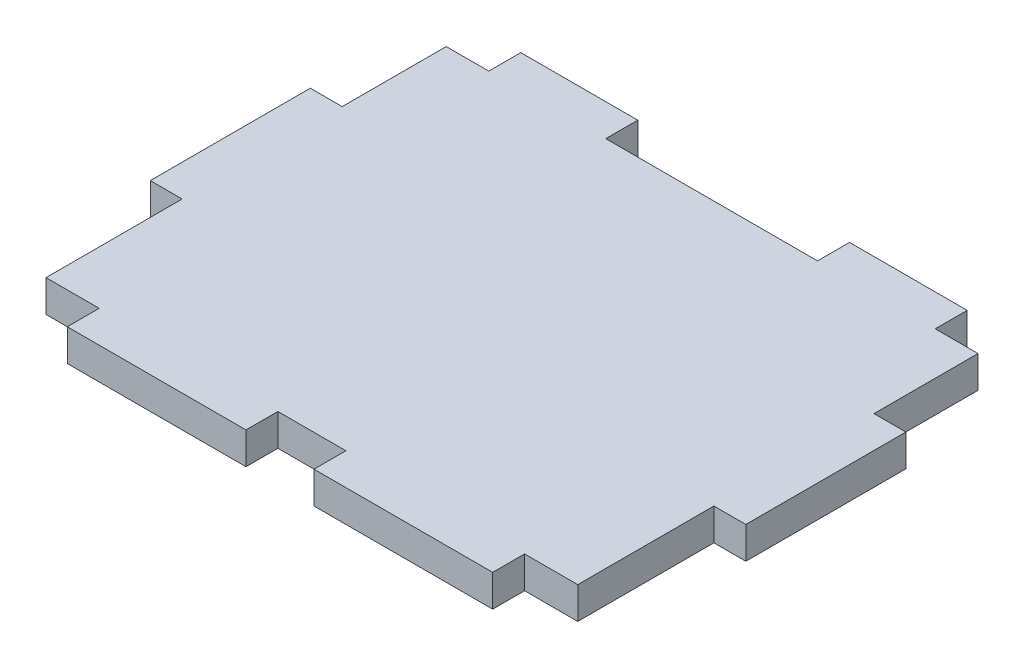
ISO-10303-21;
HEADER;
FILE_DESCRIPTION(('STEP AP214'),'2;1');
FILE_NAME('part.step','',(''),(''),'','','');
FILE_SCHEMA(('AUTOMOTIVE_DESIGN { 1 0 10303 214 1 1 1 1 }'));
ENDSEC;
DATA;
#1=APPLICATION_CONTEXT('core data for automotive mechanical design processes');
#2=APPLICATION_PROTOCOL_DEFINITION('international standard','automotive_design',2000,#1);
#3=PRODUCT_CONTEXT('',#1,'mechanical');
#4=PRODUCT('Part','Part','',(#3));
#5=PRODUCT_RELATED_PRODUCT_CATEGORY('part','',(#4));
#6=PRODUCT_DEFINITION_FORMATION('','',#4);
#7=PRODUCT_DEFINITION_CONTEXT('part definition',#1,'design');
#8=PRODUCT_DEFINITION('design','',#6,#7);
#9=PRODUCT_DEFINITION_SHAPE('','',#8);
#10=(LENGTH_UNIT() NAMED_UNIT(*) SI_UNIT(.MILLI.,.METRE.));
#11=(NAMED_UNIT(*) PLANE_ANGLE_UNIT() SI_UNIT($,.RADIAN.));
#12=(NAMED_UNIT(*) SI_UNIT($,.STERADIAN.) SOLID_ANGLE_UNIT());
#13=UNCERTAINTY_MEASURE_WITH_UNIT(LENGTH_MEASURE(1.E-05),#10,'distance_accuracy_value','');
#14=(GEOMETRIC_REPRESENTATION_CONTEXT(3) GLOBAL_UNCERTAINTY_ASSIGNED_CONTEXT((#13)) GLOBAL_UNIT_ASSIGNED_CONTEXT((#10,
#11,#12)) REPRESENTATION_CONTEXT('',''));
#15=CARTESIAN_POINT('',(0.,0.,0.));
#16=DIRECTION('',(0.,0.,1.));
#17=DIRECTION('',(1.,0.,0.));
#18=AXIS2_PLACEMENT_3D('',#15,#16,#17);
#19=CARTESIAN_POINT('',(-871.437806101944,3.,-447.227487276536));
#20=DIRECTION('',(0.,0.,-1.));
#21=DIRECTION('',(-1.,0.,0.));
#22=AXIS2_PLACEMENT_3D('',#19,#20,#21);
#23=PLANE('',#22);
#24=DIRECTION('',(1.,0.,0.));
#25=VECTOR('',#24,1.);
#26=CARTESIAN_POINT('',(-871.437806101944,0.,-447.227487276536));
#27=LINE('',#26,#25);
#28=CARTESIAN_POINT('',(-874.437806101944,0.,-447.227487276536));
#29=VERTEX_POINT('',#28);
#30=CARTESIAN_POINT('',(-871.437806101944,0.,-447.227487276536));
#31=VERTEX_POINT('',#30);
#32=EDGE_CURVE('E250',#29,#31,#27,.T.);
#33=ORIENTED_EDGE('',*,*,#32,.T.);
#34=DIRECTION('',(0.,-1.,0.));
#35=VECTOR('',#34,1.);
#36=CARTESIAN_POINT('',(-871.437806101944,3.,-447.227487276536));
#37=LINE('',#36,#35);
#38=CARTESIAN_POINT('',(-871.437806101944,3.,-447.227487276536));
#39=VERTEX_POINT('',#38);
#40=EDGE_CURVE('E11',#39,#31,#37,.T.);
#41=ORIENTED_EDGE('',*,*,#40,.F.);
#42=DIRECTION('',(1.,0.,0.));
#43=VECTOR('',#42,1.);
#44=CARTESIAN_POINT('',(-871.437806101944,3.,-447.227487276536));
#45=LINE('',#44,#43);
#46=CARTESIAN_POINT('',(-874.437806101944,3.,-447.227487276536));
#47=VERTEX_POINT('',#46);
#48=EDGE_CURVE('E304',#47,#39,#45,.T.);
#49=ORIENTED_EDGE('',*,*,#48,.F.);
#50=DIRECTION('',(0.,-1.,0.));
#51=VECTOR('',#50,1.);
#52=CARTESIAN_POINT('',(-874.437806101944,3.,-447.227487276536));
#53=LINE('',#52,#51);
#54=EDGE_CURVE('E246',#47,#29,#53,.T.);
#55=ORIENTED_EDGE('',*,*,#54,.T.);
#56=EDGE_LOOP('',(#33,#41,#49,#55));
#57=FACE_BOUND('',#56,.T.);
#58=ADVANCED_FACE('F34',(#57),#23,.F.);
#59=CARTESIAN_POINT('',(-871.437806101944,3.,-447.227487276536));
#60=DIRECTION('',(-1.,0.,0.));
#61=DIRECTION('',(0.,0.,1.));
#62=AXIS2_PLACEMENT_3D('',#59,#60,#61);
#63=PLANE('',#62);
#64=DIRECTION('',(0.,0.,-1.));
#65=VECTOR('',#64,1.);
#66=CARTESIAN_POINT('',(-871.437806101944,0.,-447.227487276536));
#67=LINE('',#66,#65);
#68=CARTESIAN_POINT('',(-871.437806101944,0.,-462.277187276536));
#69=VERTEX_POINT('',#68);
#70=EDGE_CURVE('E253',#31,#69,#67,.T.);
#71=ORIENTED_EDGE('',*,*,#70,.T.);
#72=DIRECTION('',(0.,-1.,0.));
#73=VECTOR('',#72,1.);
#74=CARTESIAN_POINT('',(-871.437806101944,3.,-462.277187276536));
#75=LINE('',#74,#73);
#76=CARTESIAN_POINT('',(-871.437806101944,3.,-462.277187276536));
#77=VERTEX_POINT('',#76);
#78=EDGE_CURVE('E42',#77,#69,#75,.T.);
#79=ORIENTED_EDGE('',*,*,#78,.F.);
#80=DIRECTION('',(0.,0.,-1.));
#81=VECTOR('',#80,1.);
#82=CARTESIAN_POINT('',(-871.437806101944,3.,-447.227487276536));
#83=LINE('',#82,#81);
#84=EDGE_CURVE('E153',#39,#77,#83,.T.);
#85=ORIENTED_EDGE('',*,*,#84,.F.);
#86=ORIENTED_EDGE('',*,*,#40,.T.);
#87=EDGE_LOOP('',(#71,#79,#85,#86));
#88=FACE_BOUND('',#87,.T.);
#89=ADVANCED_FACE('F462',(#88),#63,.F.);
#90=CARTESIAN_POINT('',(-874.437806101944,3.,-462.277187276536));
#91=DIRECTION('',(0.,0.,1.));
#92=DIRECTION('',(1.,0.,0.));
#93=AXIS2_PLACEMENT_3D('',#90,#91,#92);
#94=PLANE('',#93);
#95=DIRECTION('',(-1.,0.,0.));
#96=VECTOR('',#95,1.);
#97=CARTESIAN_POINT('',(-874.437806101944,0.,-462.277187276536));
#98=LINE('',#97,#96);
#99=CARTESIAN_POINT('',(-874.437806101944,0.,-462.277187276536));
#100=VERTEX_POINT('',#99);
#101=EDGE_CURVE('E255',#69,#100,#98,.T.);
#102=ORIENTED_EDGE('',*,*,#101,.T.);
#103=DIRECTION('',(0.,-1.,0.));
#104=VECTOR('',#103,1.);
#105=CARTESIAN_POINT('',(-874.437806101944,3.,-462.277187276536));
#106=LINE('',#105,#104);
#107=CARTESIAN_POINT('',(-874.437806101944,3.,-462.277187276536));
#108=VERTEX_POINT('',#107);
#109=EDGE_CURVE('E371',#108,#100,#106,.T.);
#110=ORIENTED_EDGE('',*,*,#109,.F.);
#111=DIRECTION('',(-1.,0.,0.));
#112=VECTOR('',#111,1.);
#113=CARTESIAN_POINT('',(-874.437806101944,3.,-462.277187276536));
#114=LINE('',#113,#112);
#115=EDGE_CURVE('E379',#77,#108,#114,.T.);
#116=ORIENTED_EDGE('',*,*,#115,.F.);
#117=ORIENTED_EDGE('',*,*,#78,.T.);
#118=EDGE_LOOP('',(#102,#110,#116,#117));
#119=FACE_BOUND('',#118,.T.);
#120=ADVANCED_FACE('F377',(#119),#94,.F.);
#121=CARTESIAN_POINT('',(-874.437806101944,3.,-462.277187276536));
#122=DIRECTION('',(-1.,0.,-1.47539451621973E-13));
#123=DIRECTION('',(-1.47539451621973E-13,0.,1.));
#124=AXIS2_PLACEMENT_3D('',#121,#122,#123);
#125=PLANE('',#124);
#126=DIRECTION('',(1.47539451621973E-13,0.,-1.));
#127=VECTOR('',#126,1.);
#128=CARTESIAN_POINT('',(-874.437806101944,0.,-462.277187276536));
#129=LINE('',#128,#127);
#130=CARTESIAN_POINT('',(-874.437806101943,0.,-472.059587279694));
#131=VERTEX_POINT('',#130);
#132=EDGE_CURVE('E257',#100,#131,#129,.T.);
#133=ORIENTED_EDGE('',*,*,#132,.T.);
#134=DIRECTION('',(0.,-1.,0.));
#135=VECTOR('',#134,1.);
#136=CARTESIAN_POINT('',(-874.437806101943,3.,-472.059587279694));
#137=LINE('',#136,#135);
#138=CARTESIAN_POINT('',(-874.437806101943,3.,-472.059587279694));
#139=VERTEX_POINT('',#138);
#140=EDGE_CURVE('E368',#139,#131,#137,.T.);
#141=ORIENTED_EDGE('',*,*,#140,.F.);
#142=DIRECTION('',(1.47539451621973E-13,0.,-1.));
#143=VECTOR('',#142,1.);
#144=CARTESIAN_POINT('',(-874.437806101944,3.,-462.277187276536));
#145=LINE('',#144,#143);
#146=EDGE_CURVE('E397',#108,#139,#145,.T.);
#147=ORIENTED_EDGE('',*,*,#146,.F.);
#148=ORIENTED_EDGE('',*,*,#109,.T.);
#149=EDGE_LOOP('',(#133,#141,#147,#148));
#150=FACE_BOUND('',#149,.T.);
#151=ADVANCED_FACE('F388',(#150),#125,.F.);
#152=CARTESIAN_POINT('',(-874.437806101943,3.,-472.059587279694));
#153=DIRECTION('',(0.,0.,1.));
#154=DIRECTION('',(1.,0.,0.));
#155=AXIS2_PLACEMENT_3D('',#152,#153,#154);
#156=PLANE('',#155);
#157=DIRECTION('',(-1.,0.,0.));
#158=VECTOR('',#157,1.);
#159=CARTESIAN_POINT('',(-874.437806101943,0.,-472.059587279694));
#160=LINE('',#159,#158);
#161=CARTESIAN_POINT('',(-878.462774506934,0.,-472.059587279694));
#162=VERTEX_POINT('',#161);
#163=EDGE_CURVE('E259',#131,#162,#160,.T.);
#164=ORIENTED_EDGE('',*,*,#163,.T.);
#165=DIRECTION('',(0.,-1.,0.));
#166=VECTOR('',#165,1.);
#167=CARTESIAN_POINT('',(-878.462774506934,3.,-472.059587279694));
#168=LINE('',#167,#166);
#169=CARTESIAN_POINT('',(-878.462774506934,3.,-472.059587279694));
#170=VERTEX_POINT('',#169);
#171=EDGE_CURVE('E365',#170,#162,#168,.T.);
#172=ORIENTED_EDGE('',*,*,#171,.F.);
#173=DIRECTION('',(-1.,0.,0.));
#174=VECTOR('',#173,1.);
#175=CARTESIAN_POINT('',(-874.437806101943,3.,-472.059587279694));
#176=LINE('',#175,#174);
#177=EDGE_CURVE('E394',#139,#170,#176,.T.);
#178=ORIENTED_EDGE('',*,*,#177,.F.);
#179=ORIENTED_EDGE('',*,*,#140,.T.);
#180=EDGE_LOOP('',(#164,#172,#178,#179));
#181=FACE_BOUND('',#180,.T.);
#182=ADVANCED_FACE('F392',(#181),#156,.F.);
#183=CARTESIAN_POINT('',(-878.462774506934,3.,-472.059587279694));
#184=DIRECTION('',(-1.,0.,0.));
#185=DIRECTION('',(0.,0.,1.));
#186=AXIS2_PLACEMENT_3D('',#183,#184,#185);
#187=PLANE('',#186);
#188=DIRECTION('',(0.,0.,-1.));
#189=VECTOR('',#188,1.);
#190=CARTESIAN_POINT('',(-878.462774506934,0.,-472.059587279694));
#191=LINE('',#190,#189);
#192=CARTESIAN_POINT('',(-878.462774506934,0.,-475.069487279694));
#193=VERTEX_POINT('',#192);
#194=EDGE_CURVE('E261',#162,#193,#191,.T.);
#195=ORIENTED_EDGE('',*,*,#194,.T.);
#196=DIRECTION('',(0.,-1.,0.));
#197=VECTOR('',#196,1.);
#198=CARTESIAN_POINT('',(-878.462774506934,3.,-475.069487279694));
#199=LINE('',#198,#197);
#200=CARTESIAN_POINT('',(-878.462774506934,3.,-475.069487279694));
#201=VERTEX_POINT('',#200);
#202=EDGE_CURVE('E362',#201,#193,#199,.T.);
#203=ORIENTED_EDGE('',*,*,#202,.F.);
#204=DIRECTION('',(0.,0.,-1.));
#205=VECTOR('',#204,1.);
#206=CARTESIAN_POINT('',(-878.462774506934,3.,-472.059587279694));
#207=LINE('',#206,#205);
#208=EDGE_CURVE('E396',#170,#201,#207,.T.);
#209=ORIENTED_EDGE('',*,*,#208,.F.);
#210=ORIENTED_EDGE('',*,*,#171,.T.);
#211=EDGE_LOOP('',(#195,#203,#209,#210));
#212=FACE_BOUND('',#211,.T.);
#213=ADVANCED_FACE('F475',(#212),#187,.F.);
#214=CARTESIAN_POINT('',(-878.462774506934,3.,-475.069487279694));
#215=DIRECTION('',(0.,0.,1.));
#216=DIRECTION('',(1.,0.,0.));
#217=AXIS2_PLACEMENT_3D('',#214,#215,#216);
#218=PLANE('',#217);
#219=DIRECTION('',(-1.,0.,0.));
#220=VECTOR('',#219,1.);
#221=CARTESIAN_POINT('',(-878.462774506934,0.,-475.069487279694));
#222=LINE('',#221,#220);
#223=CARTESIAN_POINT('',(-889.527527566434,0.,-475.069487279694));
#224=VERTEX_POINT('',#223);
#225=EDGE_CURVE('E263',#193,#224,#222,.T.);
#226=ORIENTED_EDGE('',*,*,#225,.T.);
#227=DIRECTION('',(0.,-1.,0.));
#228=VECTOR('',#227,1.);
#229=CARTESIAN_POINT('',(-889.527527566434,3.,-475.069487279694));
#230=LINE('',#229,#228);
#231=CARTESIAN_POINT('',(-889.527527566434,3.,-475.069487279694));
#232=VERTEX_POINT('',#231);
#233=EDGE_CURVE('E359',#232,#224,#230,.T.);
#234=ORIENTED_EDGE('',*,*,#233,.F.);
#235=DIRECTION('',(-1.,0.,0.));
#236=VECTOR('',#235,1.);
#237=CARTESIAN_POINT('',(-878.462774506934,3.,-475.069487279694));
#238=LINE('',#237,#236);
#239=EDGE_CURVE('E399',#201,#232,#238,.T.);
#240=ORIENTED_EDGE('',*,*,#239,.F.);
#241=ORIENTED_EDGE('',*,*,#202,.T.);
#242=EDGE_LOOP('',(#226,#234,#240,#241));
#243=FACE_BOUND('',#242,.T.);
#244=ADVANCED_FACE('F478',(#243),#218,.F.);
#245=CARTESIAN_POINT('',(-889.527527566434,3.,-475.069487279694));
#246=DIRECTION('',(1.,0.,0.));
#247=DIRECTION('',(0.,0.,-1.));
#248=AXIS2_PLACEMENT_3D('',#245,#246,#247);
#249=PLANE('',#248);
#250=DIRECTION('',(0.,0.,1.));
#251=VECTOR('',#250,1.);
#252=CARTESIAN_POINT('',(-889.527527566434,0.,-475.069487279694));
#253=LINE('',#252,#251);
#254=CARTESIAN_POINT('',(-889.527527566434,0.,-472.059587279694));
#255=VERTEX_POINT('',#254);
#256=EDGE_CURVE('E265',#224,#255,#253,.T.);
#257=ORIENTED_EDGE('',*,*,#256,.T.);
#258=DIRECTION('',(0.,-1.,0.));
#259=VECTOR('',#258,1.);
#260=CARTESIAN_POINT('',(-889.527527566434,3.,-472.059587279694));
#261=LINE('',#260,#259);
#262=CARTESIAN_POINT('',(-889.527527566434,3.,-472.059587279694));
#263=VERTEX_POINT('',#262);
#264=EDGE_CURVE('E356',#263,#255,#261,.T.);
#265=ORIENTED_EDGE('',*,*,#264,.F.);
#266=DIRECTION('',(0.,0.,1.));
#267=VECTOR('',#266,1.);
#268=CARTESIAN_POINT('',(-889.527527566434,3.,-475.069487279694));
#269=LINE('',#268,#267);
#270=EDGE_CURVE('E405',#232,#263,#269,.T.);
#271=ORIENTED_EDGE('',*,*,#270,.F.);
#272=ORIENTED_EDGE('',*,*,#233,.T.);
#273=EDGE_LOOP('',(#257,#265,#271,#272));
#274=FACE_BOUND('',#273,.T.);
#275=ADVANCED_FACE('F482',(#274),#249,.F.);
#276=CARTESIAN_POINT('',(-909.437806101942,3.,-472.059587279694));
#277=DIRECTION('',(0.,0.,1.));
#278=DIRECTION('',(1.,0.,0.));
#279=AXIS2_PLACEMENT_3D('',#276,#277,#278);
#280=PLANE('',#279);
#281=DIRECTION('',(-1.,0.,0.));
#282=VECTOR('',#281,1.);
#283=CARTESIAN_POINT('',(-909.437806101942,0.,-472.059587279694));
#284=LINE('',#283,#282);
#285=CARTESIAN_POINT('',(-909.437806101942,0.,-472.059587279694));
#286=VERTEX_POINT('',#285);
#287=EDGE_CURVE('E267',#255,#286,#284,.T.);
#288=ORIENTED_EDGE('',*,*,#287,.T.);
#289=DIRECTION('',(0.,-1.,0.));
#290=VECTOR('',#289,1.);
#291=CARTESIAN_POINT('',(-909.437806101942,3.,-472.059587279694));
#292=LINE('',#291,#290);
#293=CARTESIAN_POINT('',(-909.437806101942,3.,-472.059587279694));
#294=VERTEX_POINT('',#293);
#295=EDGE_CURVE('E353',#294,#286,#292,.T.);
#296=ORIENTED_EDGE('',*,*,#295,.F.);
#297=DIRECTION('',(-1.,0.,0.));
#298=VECTOR('',#297,1.);
#299=CARTESIAN_POINT('',(-909.437806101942,3.,-472.059587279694));
#300=LINE('',#299,#298);
#301=EDGE_CURVE('E407',#263,#294,#300,.T.);
#302=ORIENTED_EDGE('',*,*,#301,.F.);
#303=ORIENTED_EDGE('',*,*,#264,.T.);
#304=EDGE_LOOP('',(#288,#296,#302,#303));
#305=FACE_BOUND('',#304,.T.);
#306=ADVANCED_FACE('F486',(#305),#280,.F.);
#307=CARTESIAN_POINT('',(-909.437806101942,3.,-475.069487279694));
#308=DIRECTION('',(-1.,0.,0.));
#309=DIRECTION('',(0.,0.,1.));
#310=AXIS2_PLACEMENT_3D('',#307,#308,#309);
#311=PLANE('',#310);
#312=DIRECTION('',(0.,0.,-1.));
#313=VECTOR('',#312,1.);
#314=CARTESIAN_POINT('',(-909.437806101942,0.,-475.069487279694));
#315=LINE('',#314,#313);
#316=CARTESIAN_POINT('',(-909.437806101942,0.,-475.069487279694));
#317=VERTEX_POINT('',#316);
#318=EDGE_CURVE('E269',#286,#317,#315,.T.);
#319=ORIENTED_EDGE('',*,*,#318,.T.);
#320=DIRECTION('',(0.,-1.,0.));
#321=VECTOR('',#320,1.);
#322=CARTESIAN_POINT('',(-909.437806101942,3.,-475.069487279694));
#323=LINE('',#322,#321);
#324=CARTESIAN_POINT('',(-909.437806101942,3.,-475.069487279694));
#325=VERTEX_POINT('',#324);
#326=EDGE_CURVE('E350',#325,#317,#323,.T.);
#327=ORIENTED_EDGE('',*,*,#326,.F.);
#328=DIRECTION('',(0.,0.,-1.));
#329=VECTOR('',#328,1.);
#330=CARTESIAN_POINT('',(-909.437806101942,3.,-475.069487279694));
#331=LINE('',#330,#329);
#332=EDGE_CURVE('E409',#294,#325,#331,.T.);
#333=ORIENTED_EDGE('',*,*,#332,.F.);
#334=ORIENTED_EDGE('',*,*,#295,.T.);
#335=EDGE_LOOP('',(#319,#327,#333,#334));
#336=FACE_BOUND('',#335,.T.);
#337=ADVANCED_FACE('F490',(#336),#311,.F.);
#338=CARTESIAN_POINT('',(-920.437806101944,3.,-475.069487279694));
#339=DIRECTION('',(0.,0.,1.));
#340=DIRECTION('',(1.,0.,0.));
#341=AXIS2_PLACEMENT_3D('',#338,#339,#340);
#342=PLANE('',#341);
#343=DIRECTION('',(-1.,0.,0.));
#344=VECTOR('',#343,1.);
#345=CARTESIAN_POINT('',(-920.437806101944,0.,-475.069487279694));
#346=LINE('',#345,#344);
#347=CARTESIAN_POINT('',(-920.437806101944,0.,-475.069487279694));
#348=VERTEX_POINT('',#347);
#349=EDGE_CURVE('E271',#317,#348,#346,.T.);
#350=ORIENTED_EDGE('',*,*,#349,.T.);
#351=DIRECTION('',(0.,-1.,0.));
#352=VECTOR('',#351,1.);
#353=CARTESIAN_POINT('',(-920.437806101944,3.,-475.069487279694));
#354=LINE('',#353,#352);
#355=CARTESIAN_POINT('',(-920.437806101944,3.,-475.069487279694));
#356=VERTEX_POINT('',#355);
#357=EDGE_CURVE('E347',#356,#348,#354,.T.);
#358=ORIENTED_EDGE('',*,*,#357,.F.);
#359=DIRECTION('',(-1.,0.,0.));
#360=VECTOR('',#359,1.);
#361=CARTESIAN_POINT('',(-920.437806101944,3.,-475.069487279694));
#362=LINE('',#361,#360);
#363=EDGE_CURVE('E411',#325,#356,#362,.T.);
#364=ORIENTED_EDGE('',*,*,#363,.F.);
#365=ORIENTED_EDGE('',*,*,#326,.T.);
#366=EDGE_LOOP('',(#350,#358,#364,#365));
#367=FACE_BOUND('',#366,.T.);
#368=ADVANCED_FACE('F494',(#367),#342,.F.);
#369=CARTESIAN_POINT('',(-920.437806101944,3.,-472.059587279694));
#370=DIRECTION('',(1.,0.,0.));
#371=DIRECTION('',(0.,0.,-1.));
#372=AXIS2_PLACEMENT_3D('',#369,#370,#371);
#373=PLANE('',#372);
#374=DIRECTION('',(0.,0.,1.));
#375=VECTOR('',#374,1.);
#376=CARTESIAN_POINT('',(-920.437806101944,0.,-472.059587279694));
#377=LINE('',#376,#375);
#378=CARTESIAN_POINT('',(-920.437806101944,0.,-472.059587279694));
#379=VERTEX_POINT('',#378);
#380=EDGE_CURVE('E273',#348,#379,#377,.T.);
#381=ORIENTED_EDGE('',*,*,#380,.T.);
#382=DIRECTION('',(0.,-1.,0.));
#383=VECTOR('',#382,1.);
#384=CARTESIAN_POINT('',(-920.437806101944,3.,-472.059587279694));
#385=LINE('',#384,#383);
#386=CARTESIAN_POINT('',(-920.437806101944,3.,-472.059587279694));
#387=VERTEX_POINT('',#386);
#388=EDGE_CURVE('E344',#387,#379,#385,.T.);
#389=ORIENTED_EDGE('',*,*,#388,.F.);
#390=DIRECTION('',(0.,0.,1.));
#391=VECTOR('',#390,1.);
#392=CARTESIAN_POINT('',(-920.437806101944,3.,-472.059587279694));
#393=LINE('',#392,#391);
#394=EDGE_CURVE('E413',#356,#387,#393,.T.);
#395=ORIENTED_EDGE('',*,*,#394,.F.);
#396=ORIENTED_EDGE('',*,*,#357,.T.);
#397=EDGE_LOOP('',(#381,#389,#395,#396));
#398=FACE_BOUND('',#397,.T.);
#399=ADVANCED_FACE('F498',(#398),#373,.F.);
#400=CARTESIAN_POINT('',(-924.437806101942,3.,-472.059587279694));
#401=DIRECTION('',(0.,0.,1.));
#402=DIRECTION('',(1.,0.,0.));
#403=AXIS2_PLACEMENT_3D('',#400,#401,#402);
#404=PLANE('',#403);
#405=DIRECTION('',(-1.,0.,0.));
#406=VECTOR('',#405,1.);
#407=CARTESIAN_POINT('',(-924.437806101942,0.,-472.059587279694));
#408=LINE('',#407,#406);
#409=CARTESIAN_POINT('',(-924.437806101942,0.,-472.059587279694));
#410=VERTEX_POINT('',#409);
#411=EDGE_CURVE('E275',#379,#410,#408,.T.);
#412=ORIENTED_EDGE('',*,*,#411,.T.);
#413=DIRECTION('',(0.,-1.,0.));
#414=VECTOR('',#413,1.);
#415=CARTESIAN_POINT('',(-924.437806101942,3.,-472.059587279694));
#416=LINE('',#415,#414);
#417=CARTESIAN_POINT('',(-924.437806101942,3.,-472.059587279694));
#418=VERTEX_POINT('',#417);
#419=EDGE_CURVE('E341',#418,#410,#416,.T.);
#420=ORIENTED_EDGE('',*,*,#419,.F.);
#421=DIRECTION('',(-1.,0.,0.));
#422=VECTOR('',#421,1.);
#423=CARTESIAN_POINT('',(-924.437806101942,3.,-472.059587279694));
#424=LINE('',#423,#422);
#425=EDGE_CURVE('E415',#387,#418,#424,.T.);
#426=ORIENTED_EDGE('',*,*,#425,.F.);
#427=ORIENTED_EDGE('',*,*,#388,.T.);
#428=EDGE_LOOP('',(#412,#420,#426,#427));
#429=FACE_BOUND('',#428,.T.);
#430=ADVANCED_FACE('F502',(#429),#404,.F.);
#431=CARTESIAN_POINT('',(-924.437806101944,3.,-462.277187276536));
#432=DIRECTION('',(1.,0.,1.3619026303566E-13));
#433=DIRECTION('',(1.3619026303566E-13,0.,-1.));
#434=AXIS2_PLACEMENT_3D('',#431,#432,#433);
#435=PLANE('',#434);
#436=DIRECTION('',(-1.3619026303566E-13,0.,1.));
#437=VECTOR('',#436,1.);
#438=CARTESIAN_POINT('',(-924.437806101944,0.,-462.277187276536));
#439=LINE('',#438,#437);
#440=CARTESIAN_POINT('',(-924.437806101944,0.,-462.277187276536));
#441=VERTEX_POINT('',#440);
#442=EDGE_CURVE('E277',#410,#441,#439,.T.);
#443=ORIENTED_EDGE('',*,*,#442,.T.);
#444=DIRECTION('',(0.,-1.,0.));
#445=VECTOR('',#444,1.);
#446=CARTESIAN_POINT('',(-924.437806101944,3.,-462.277187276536));
#447=LINE('',#446,#445);
#448=CARTESIAN_POINT('',(-924.437806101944,3.,-462.277187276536));
#449=VERTEX_POINT('',#448);
#450=EDGE_CURVE('E338',#449,#441,#447,.T.);
#451=ORIENTED_EDGE('',*,*,#450,.F.);
#452=DIRECTION('',(-1.3619026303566E-13,0.,1.));
#453=VECTOR('',#452,1.);
#454=CARTESIAN_POINT('',(-924.437806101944,3.,-462.277187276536));
#455=LINE('',#454,#453);
#456=EDGE_CURVE('E417',#418,#449,#455,.T.);
#457=ORIENTED_EDGE('',*,*,#456,.F.);
#458=ORIENTED_EDGE('',*,*,#419,.T.);
#459=EDGE_LOOP('',(#443,#451,#457,#458));
#460=FACE_BOUND('',#459,.T.);
#461=ADVANCED_FACE('F506',(#460),#435,.F.);
#462=CARTESIAN_POINT('',(-924.437806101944,3.,-462.277187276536));
#463=DIRECTION('',(0.,0.,1.));
#464=DIRECTION('',(1.,0.,0.));
#465=AXIS2_PLACEMENT_3D('',#462,#463,#464);
#466=PLANE('',#465);
#467=DIRECTION('',(-1.,0.,0.));
#468=VECTOR('',#467,1.);
#469=CARTESIAN_POINT('',(-924.437806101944,0.,-462.277187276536));
#470=LINE('',#469,#468);
#471=CARTESIAN_POINT('',(-927.437806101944,0.,-462.277187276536));
#472=VERTEX_POINT('',#471);
#473=EDGE_CURVE('E279',#441,#472,#470,.T.);
#474=ORIENTED_EDGE('',*,*,#473,.T.);
#475=DIRECTION('',(0.,-1.,0.));
#476=VECTOR('',#475,1.);
#477=CARTESIAN_POINT('',(-927.437806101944,3.,-462.277187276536));
#478=LINE('',#477,#476);
#479=CARTESIAN_POINT('',(-927.437806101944,3.,-462.277187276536));
#480=VERTEX_POINT('',#479);
#481=EDGE_CURVE('E335',#480,#472,#478,.T.);
#482=ORIENTED_EDGE('',*,*,#481,.F.);
#483=DIRECTION('',(-1.,0.,0.));
#484=VECTOR('',#483,1.);
#485=CARTESIAN_POINT('',(-924.437806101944,3.,-462.277187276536));
#486=LINE('',#485,#484);
#487=EDGE_CURVE('E419',#449,#480,#486,.T.);
#488=ORIENTED_EDGE('',*,*,#487,.F.);
#489=ORIENTED_EDGE('',*,*,#450,.T.);
#490=EDGE_LOOP('',(#474,#482,#488,#489));
#491=FACE_BOUND('',#490,.T.);
#492=ADVANCED_FACE('F510',(#491),#466,.F.);
#493=CARTESIAN_POINT('',(-927.437806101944,3.,-447.227487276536));
#494=DIRECTION('',(1.,0.,0.));
#495=DIRECTION('',(0.,0.,-1.));
#496=AXIS2_PLACEMENT_3D('',#493,#494,#495);
#497=PLANE('',#496);
#498=DIRECTION('',(0.,0.,1.));
#499=VECTOR('',#498,1.);
#500=CARTESIAN_POINT('',(-927.437806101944,0.,-447.227487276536));
#501=LINE('',#500,#499);
#502=CARTESIAN_POINT('',(-927.437806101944,0.,-447.227487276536));
#503=VERTEX_POINT('',#502);
#504=EDGE_CURVE('E281',#472,#503,#501,.T.);
#505=ORIENTED_EDGE('',*,*,#504,.T.);
#506=DIRECTION('',(0.,-1.,0.));
#507=VECTOR('',#506,1.);
#508=CARTESIAN_POINT('',(-927.437806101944,3.,-447.227487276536));
#509=LINE('',#508,#507);
#510=CARTESIAN_POINT('',(-927.437806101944,3.,-447.227487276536));
#511=VERTEX_POINT('',#510);
#512=EDGE_CURVE('E332',#511,#503,#509,.T.);
#513=ORIENTED_EDGE('',*,*,#512,.F.);
#514=DIRECTION('',(0.,0.,1.));
#515=VECTOR('',#514,1.);
#516=CARTESIAN_POINT('',(-927.437806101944,3.,-447.227487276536));
#517=LINE('',#516,#515);
#518=EDGE_CURVE('E421',#480,#511,#517,.T.);
#519=ORIENTED_EDGE('',*,*,#518,.F.);
#520=ORIENTED_EDGE('',*,*,#481,.T.);
#521=EDGE_LOOP('',(#505,#513,#519,#520));
#522=FACE_BOUND('',#521,.T.);
#523=ADVANCED_FACE('F514',(#522),#497,.F.);
#524=CARTESIAN_POINT('',(-927.437806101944,3.,-447.227487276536));
#525=DIRECTION('',(0.,0.,-1.));
#526=DIRECTION('',(-1.,0.,0.));
#527=AXIS2_PLACEMENT_3D('',#524,#525,#526);
#528=PLANE('',#527);
#529=DIRECTION('',(1.,0.,0.));
#530=VECTOR('',#529,1.);
#531=CARTESIAN_POINT('',(-927.437806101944,0.,-447.227487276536));
#532=LINE('',#531,#530);
#533=CARTESIAN_POINT('',(-924.437806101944,0.,-447.227487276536));
#534=VERTEX_POINT('',#533);
#535=EDGE_CURVE('E283',#503,#534,#532,.T.);
#536=ORIENTED_EDGE('',*,*,#535,.T.);
#537=DIRECTION('',(0.,-1.,0.));
#538=VECTOR('',#537,1.);
#539=CARTESIAN_POINT('',(-924.437806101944,3.,-447.227487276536));
#540=LINE('',#539,#538);
#541=CARTESIAN_POINT('',(-924.437806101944,3.,-447.227487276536));
#542=VERTEX_POINT('',#541);
#543=EDGE_CURVE('E329',#542,#534,#540,.T.);
#544=ORIENTED_EDGE('',*,*,#543,.F.);
#545=DIRECTION('',(1.,0.,0.));
#546=VECTOR('',#545,1.);
#547=CARTESIAN_POINT('',(-927.437806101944,3.,-447.227487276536));
#548=LINE('',#547,#546);
#549=EDGE_CURVE('E423',#511,#542,#548,.T.);
#550=ORIENTED_EDGE('',*,*,#549,.F.);
#551=ORIENTED_EDGE('',*,*,#512,.T.);
#552=EDGE_LOOP('',(#536,#544,#550,#551));
#553=FACE_BOUND('',#552,.T.);
#554=ADVANCED_FACE('F518',(#553),#528,.F.);
#555=CARTESIAN_POINT('',(-924.437806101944,3.,-447.227487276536));
#556=DIRECTION('',(1.,0.,0.));
#557=DIRECTION('',(0.,0.,-1.));
#558=AXIS2_PLACEMENT_3D('',#555,#556,#557);
#559=PLANE('',#558);
#560=DIRECTION('',(0.,0.,1.));
#561=VECTOR('',#560,1.);
#562=CARTESIAN_POINT('',(-924.437806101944,0.,-447.227487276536));
#563=LINE('',#562,#561);
#564=CARTESIAN_POINT('',(-924.437806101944,0.,-434.424887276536));
#565=VERTEX_POINT('',#564);
#566=EDGE_CURVE('E285',#534,#565,#563,.T.);
#567=ORIENTED_EDGE('',*,*,#566,.T.);
#568=DIRECTION('',(0.,-1.,0.));
#569=VECTOR('',#568,1.);
#570=CARTESIAN_POINT('',(-924.437806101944,3.,-434.424887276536));
#571=LINE('',#570,#569);
#572=CARTESIAN_POINT('',(-924.437806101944,3.,-434.424887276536));
#573=VERTEX_POINT('',#572);
#574=EDGE_CURVE('E326',#573,#565,#571,.T.);
#575=ORIENTED_EDGE('',*,*,#574,.F.);
#576=DIRECTION('',(0.,0.,1.));
#577=VECTOR('',#576,1.);
#578=CARTESIAN_POINT('',(-924.437806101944,3.,-447.227487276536));
#579=LINE('',#578,#577);
#580=EDGE_CURVE('E425',#542,#573,#579,.T.);
#581=ORIENTED_EDGE('',*,*,#580,.F.);
#582=ORIENTED_EDGE('',*,*,#543,.T.);
#583=EDGE_LOOP('',(#567,#575,#581,#582));
#584=FACE_BOUND('',#583,.T.);
#585=ADVANCED_FACE('F522',(#584),#559,.F.);
#586=CARTESIAN_POINT('',(-924.437806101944,3.,-434.424887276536));
#587=DIRECTION('',(0.,0.,-1.));
#588=DIRECTION('',(-1.,0.,0.));
#589=AXIS2_PLACEMENT_3D('',#586,#587,#588);
#590=PLANE('',#589);
#591=DIRECTION('',(1.,0.,0.));
#592=VECTOR('',#591,1.);
#593=CARTESIAN_POINT('',(-924.437806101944,0.,-434.424887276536));
#594=LINE('',#593,#592);
#595=CARTESIAN_POINT('',(-919.437806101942,0.,-434.424887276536));
#596=VERTEX_POINT('',#595);
#597=EDGE_CURVE('E287',#565,#596,#594,.T.);
#598=ORIENTED_EDGE('',*,*,#597,.T.);
#599=DIRECTION('',(0.,-1.,0.));
#600=VECTOR('',#599,1.);
#601=CARTESIAN_POINT('',(-919.437806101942,3.,-434.424887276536));
#602=LINE('',#601,#600);
#603=CARTESIAN_POINT('',(-919.437806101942,3.,-434.424887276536));
#604=VERTEX_POINT('',#603);
#605=EDGE_CURVE('E323',#604,#596,#602,.T.);
#606=ORIENTED_EDGE('',*,*,#605,.F.);
#607=DIRECTION('',(1.,0.,0.));
#608=VECTOR('',#607,1.);
#609=CARTESIAN_POINT('',(-924.437806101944,3.,-434.424887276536));
#610=LINE('',#609,#608);
#611=EDGE_CURVE('E427',#573,#604,#610,.T.);
#612=ORIENTED_EDGE('',*,*,#611,.F.);
#613=ORIENTED_EDGE('',*,*,#574,.T.);
#614=EDGE_LOOP('',(#598,#606,#612,#613));
#615=FACE_BOUND('',#614,.T.);
#616=ADVANCED_FACE('F526',(#615),#590,.F.);
#617=CARTESIAN_POINT('',(-919.437806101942,3.,-434.424887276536));
#618=DIRECTION('',(1.,0.,0.));
#619=DIRECTION('',(0.,0.,-1.));
#620=AXIS2_PLACEMENT_3D('',#617,#618,#619);
#621=PLANE('',#620);
#622=DIRECTION('',(0.,0.,1.));
#623=VECTOR('',#622,1.);
#624=CARTESIAN_POINT('',(-919.437806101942,0.,-434.424887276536));
#625=LINE('',#624,#623);
#626=CARTESIAN_POINT('',(-919.437806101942,0.,-431.424887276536));
#627=VERTEX_POINT('',#626);
#628=EDGE_CURVE('E289',#596,#627,#625,.T.);
#629=ORIENTED_EDGE('',*,*,#628,.T.);
#630=DIRECTION('',(0.,-1.,0.));
#631=VECTOR('',#630,1.);
#632=CARTESIAN_POINT('',(-919.437806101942,3.,-431.424887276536));
#633=LINE('',#632,#631);
#634=CARTESIAN_POINT('',(-919.437806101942,3.,-431.424887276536));
#635=VERTEX_POINT('',#634);
#636=EDGE_CURVE('E320',#635,#627,#633,.T.);
#637=ORIENTED_EDGE('',*,*,#636,.F.);
#638=DIRECTION('',(0.,0.,1.));
#639=VECTOR('',#638,1.);
#640=CARTESIAN_POINT('',(-919.437806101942,3.,-434.424887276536));
#641=LINE('',#640,#639);
#642=EDGE_CURVE('E429',#604,#635,#641,.T.);
#643=ORIENTED_EDGE('',*,*,#642,.F.);
#644=ORIENTED_EDGE('',*,*,#605,.T.);
#645=EDGE_LOOP('',(#629,#637,#643,#644));
#646=FACE_BOUND('',#645,.T.);
#647=ADVANCED_FACE('F530',(#646),#621,.F.);
#648=CARTESIAN_POINT('',(-919.437806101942,3.,-431.424887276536));
#649=DIRECTION('',(0.,0.,-1.));
#650=DIRECTION('',(-1.,0.,0.));
#651=AXIS2_PLACEMENT_3D('',#648,#649,#650);
#652=PLANE('',#651);
#653=DIRECTION('',(1.,0.,0.));
#654=VECTOR('',#653,1.);
#655=CARTESIAN_POINT('',(-919.437806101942,0.,-431.424887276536));
#656=LINE('',#655,#654);
#657=CARTESIAN_POINT('',(-902.635539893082,0.,-431.424887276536));
#658=VERTEX_POINT('',#657);
#659=EDGE_CURVE('E291',#627,#658,#656,.T.);
#660=ORIENTED_EDGE('',*,*,#659,.T.);
#661=DIRECTION('',(0.,-1.,0.));
#662=VECTOR('',#661,1.);
#663=CARTESIAN_POINT('',(-902.635539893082,3.,-431.424887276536));
#664=LINE('',#663,#662);
#665=CARTESIAN_POINT('',(-902.635539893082,3.,-431.424887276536));
#666=VERTEX_POINT('',#665);
#667=EDGE_CURVE('E317',#666,#658,#664,.T.);
#668=ORIENTED_EDGE('',*,*,#667,.F.);
#669=DIRECTION('',(1.,0.,0.));
#670=VECTOR('',#669,1.);
#671=CARTESIAN_POINT('',(-919.437806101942,3.,-431.424887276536));
#672=LINE('',#671,#670);
#673=EDGE_CURVE('E431',#635,#666,#672,.T.);
#674=ORIENTED_EDGE('',*,*,#673,.F.);
#675=ORIENTED_EDGE('',*,*,#636,.T.);
#676=EDGE_LOOP('',(#660,#668,#674,#675));
#677=FACE_BOUND('',#676,.T.);
#678=ADVANCED_FACE('F534',(#677),#652,.F.);
#679=CARTESIAN_POINT('',(-902.635539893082,3.,-431.424887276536));
#680=DIRECTION('',(-1.,0.,0.));
#681=DIRECTION('',(0.,0.,1.));
#682=AXIS2_PLACEMENT_3D('',#679,#680,#681);
#683=PLANE('',#682);
#684=DIRECTION('',(0.,0.,-1.));
#685=VECTOR('',#684,1.);
#686=CARTESIAN_POINT('',(-902.635539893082,0.,-431.424887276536));
#687=LINE('',#686,#685);
#688=CARTESIAN_POINT('',(-902.635539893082,0.,-434.424887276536));
#689=VERTEX_POINT('',#688);
#690=EDGE_CURVE('E293',#658,#689,#687,.T.);
#691=ORIENTED_EDGE('',*,*,#690,.T.);
#692=DIRECTION('',(0.,-1.,0.));
#693=VECTOR('',#692,1.);
#694=CARTESIAN_POINT('',(-902.635539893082,3.,-434.424887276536));
#695=LINE('',#694,#693);
#696=CARTESIAN_POINT('',(-902.635539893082,3.,-434.424887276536));
#697=VERTEX_POINT('',#696);
#698=EDGE_CURVE('E314',#697,#689,#695,.T.);
#699=ORIENTED_EDGE('',*,*,#698,.F.);
#700=DIRECTION('',(0.,0.,-1.));
#701=VECTOR('',#700,1.);
#702=CARTESIAN_POINT('',(-902.635539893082,3.,-431.424887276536));
#703=LINE('',#702,#701);
#704=EDGE_CURVE('E433',#666,#697,#703,.T.);
#705=ORIENTED_EDGE('',*,*,#704,.F.);
#706=ORIENTED_EDGE('',*,*,#667,.T.);
#707=EDGE_LOOP('',(#691,#699,#705,#706));
#708=FACE_BOUND('',#707,.T.);
#709=ADVANCED_FACE('F538',(#708),#683,.F.);
#710=CARTESIAN_POINT('',(-902.635539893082,3.,-434.424887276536));
#711=DIRECTION('',(0.,0.,-1.));
#712=DIRECTION('',(-1.,0.,0.));
#713=AXIS2_PLACEMENT_3D('',#710,#711,#712);
#714=PLANE('',#713);
#715=DIRECTION('',(1.,0.,0.));
#716=VECTOR('',#715,1.);
#717=CARTESIAN_POINT('',(-902.635539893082,0.,-434.424887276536));
#718=LINE('',#717,#716);
#719=CARTESIAN_POINT('',(-896.240072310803,0.,-434.424887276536));
#720=VERTEX_POINT('',#719);
#721=EDGE_CURVE('E295',#689,#720,#718,.T.);
#722=ORIENTED_EDGE('',*,*,#721,.T.);
#723=DIRECTION('',(0.,-1.,0.));
#724=VECTOR('',#723,1.);
#725=CARTESIAN_POINT('',(-896.240072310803,3.,-434.424887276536));
#726=LINE('',#725,#724);
#727=CARTESIAN_POINT('',(-896.240072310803,3.,-434.424887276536));
#728=VERTEX_POINT('',#727);
#729=EDGE_CURVE('E311',#728,#720,#726,.T.);
#730=ORIENTED_EDGE('',*,*,#729,.F.);
#731=DIRECTION('',(1.,0.,0.));
#732=VECTOR('',#731,1.);
#733=CARTESIAN_POINT('',(-902.635539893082,3.,-434.424887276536));
#734=LINE('',#733,#732);
#735=EDGE_CURVE('E435',#697,#728,#734,.T.);
#736=ORIENTED_EDGE('',*,*,#735,.F.);
#737=ORIENTED_EDGE('',*,*,#698,.T.);
#738=EDGE_LOOP('',(#722,#730,#736,#737));
#739=FACE_BOUND('',#738,.T.);
#740=ADVANCED_FACE('F542',(#739),#714,.F.);
#741=CARTESIAN_POINT('',(-896.240072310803,3.,-434.424887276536));
#742=DIRECTION('',(1.,0.,0.));
#743=DIRECTION('',(0.,0.,-1.));
#744=AXIS2_PLACEMENT_3D('',#741,#742,#743);
#745=PLANE('',#744);
#746=DIRECTION('',(0.,0.,1.));
#747=VECTOR('',#746,1.);
#748=CARTESIAN_POINT('',(-896.240072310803,0.,-434.424887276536));
#749=LINE('',#748,#747);
#750=CARTESIAN_POINT('',(-896.240072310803,0.,-431.424887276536));
#751=VERTEX_POINT('',#750);
#752=EDGE_CURVE('E297',#720,#751,#749,.T.);
#753=ORIENTED_EDGE('',*,*,#752,.T.);
#754=DIRECTION('',(0.,-1.,0.));
#755=VECTOR('',#754,1.);
#756=CARTESIAN_POINT('',(-896.240072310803,3.,-431.424887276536));
#757=LINE('',#756,#755);
#758=CARTESIAN_POINT('',(-896.240072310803,3.,-431.424887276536));
#759=VERTEX_POINT('',#758);
#760=EDGE_CURVE('E308',#759,#751,#757,.T.);
#761=ORIENTED_EDGE('',*,*,#760,.F.);
#762=DIRECTION('',(0.,0.,1.));
#763=VECTOR('',#762,1.);
#764=CARTESIAN_POINT('',(-896.240072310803,3.,-434.424887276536));
#765=LINE('',#764,#763);
#766=EDGE_CURVE('E437',#728,#759,#765,.T.);
#767=ORIENTED_EDGE('',*,*,#766,.F.);
#768=ORIENTED_EDGE('',*,*,#729,.T.);
#769=EDGE_LOOP('',(#753,#761,#767,#768));
#770=FACE_BOUND('',#769,.T.);
#771=ADVANCED_FACE('F443',(#770),#745,.F.);
#772=CARTESIAN_POINT('',(-896.240072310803,3.,-431.424887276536));
#773=DIRECTION('',(0.,0.,-1.));
#774=DIRECTION('',(-1.,0.,0.));
#775=AXIS2_PLACEMENT_3D('',#772,#773,#774);
#776=PLANE('',#775);
#777=DIRECTION('',(1.,0.,0.));
#778=VECTOR('',#777,1.);
#779=CARTESIAN_POINT('',(-896.240072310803,0.,-431.424887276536));
#780=LINE('',#779,#778);
#781=CARTESIAN_POINT('',(-879.437806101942,0.,-431.424887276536));
#782=VERTEX_POINT('',#781);
#783=EDGE_CURVE('E299',#751,#782,#780,.T.);
#784=ORIENTED_EDGE('',*,*,#783,.T.);
#785=DIRECTION('',(0.,-1.,0.));
#786=VECTOR('',#785,1.);
#787=CARTESIAN_POINT('',(-879.437806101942,3.,-431.424887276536));
#788=LINE('',#787,#786);
#789=CARTESIAN_POINT('',(-879.437806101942,3.,-431.424887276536));
#790=VERTEX_POINT('',#789);
#791=EDGE_CURVE('E241',#790,#782,#788,.T.);
#792=ORIENTED_EDGE('',*,*,#791,.F.);
#793=DIRECTION('',(1.,0.,0.));
#794=VECTOR('',#793,1.);
#795=CARTESIAN_POINT('',(-896.240072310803,3.,-431.424887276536));
#796=LINE('',#795,#794);
#797=EDGE_CURVE('E232',#759,#790,#796,.T.);
#798=ORIENTED_EDGE('',*,*,#797,.F.);
#799=ORIENTED_EDGE('',*,*,#760,.T.);
#800=EDGE_LOOP('',(#784,#792,#798,#799));
#801=FACE_BOUND('',#800,.T.);
#802=ADVANCED_FACE('F447',(#801),#776,.F.);
#803=CARTESIAN_POINT('',(-879.437806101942,3.,-431.424887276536));
#804=DIRECTION('',(-1.,0.,0.));
#805=DIRECTION('',(0.,0.,1.));
#806=AXIS2_PLACEMENT_3D('',#803,#804,#805);
#807=PLANE('',#806);
#808=DIRECTION('',(0.,0.,-1.));
#809=VECTOR('',#808,1.);
#810=CARTESIAN_POINT('',(-879.437806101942,0.,-431.424887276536));
#811=LINE('',#810,#809);
#812=CARTESIAN_POINT('',(-879.437806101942,0.,-434.424887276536));
#813=VERTEX_POINT('',#812);
#814=EDGE_CURVE('E240',#782,#813,#811,.T.);
#815=ORIENTED_EDGE('',*,*,#814,.T.);
#816=DIRECTION('',(0.,-1.,0.));
#817=VECTOR('',#816,1.);
#818=CARTESIAN_POINT('',(-879.437806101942,3.,-434.424887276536));
#819=LINE('',#818,#817);
#820=CARTESIAN_POINT('',(-879.437806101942,3.,-434.424887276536));
#821=VERTEX_POINT('',#820);
#822=EDGE_CURVE('E237',#821,#813,#819,.T.);
#823=ORIENTED_EDGE('',*,*,#822,.F.);
#824=DIRECTION('',(0.,0.,-1.));
#825=VECTOR('',#824,1.);
#826=CARTESIAN_POINT('',(-879.437806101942,3.,-431.424887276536));
#827=LINE('',#826,#825);
#828=EDGE_CURVE('E226',#790,#821,#827,.T.);
#829=ORIENTED_EDGE('',*,*,#828,.F.);
#830=ORIENTED_EDGE('',*,*,#791,.T.);
#831=EDGE_LOOP('',(#815,#823,#829,#830));
#832=FACE_BOUND('',#831,.T.);
#833=ADVANCED_FACE('F238',(#832),#807,.F.);
#834=CARTESIAN_POINT('',(-879.437806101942,3.,-434.424887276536));
#835=DIRECTION('',(0.,0.,-1.));
#836=DIRECTION('',(-1.,0.,0.));
#837=AXIS2_PLACEMENT_3D('',#834,#835,#836);
#838=PLANE('',#837);
#839=DIRECTION('',(1.,0.,0.));
#840=VECTOR('',#839,1.);
#841=CARTESIAN_POINT('',(-879.437806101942,0.,-434.424887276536));
#842=LINE('',#841,#840);
#843=CARTESIAN_POINT('',(-874.437806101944,0.,-434.424887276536));
#844=VERTEX_POINT('',#843);
#845=EDGE_CURVE('E139',#813,#844,#842,.T.);
#846=ORIENTED_EDGE('',*,*,#845,.T.);
#847=DIRECTION('',(0.,-1.,0.));
#848=VECTOR('',#847,1.);
#849=CARTESIAN_POINT('',(-874.437806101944,3.,-434.424887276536));
#850=LINE('',#849,#848);
#851=CARTESIAN_POINT('',(-874.437806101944,3.,-434.424887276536));
#852=VERTEX_POINT('',#851);
#853=EDGE_CURVE('E242',#852,#844,#850,.T.);
#854=ORIENTED_EDGE('',*,*,#853,.F.);
#855=DIRECTION('',(1.,0.,0.));
#856=VECTOR('',#855,1.);
#857=CARTESIAN_POINT('',(-879.437806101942,3.,-434.424887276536));
#858=LINE('',#857,#856);
#859=EDGE_CURVE('E230',#821,#852,#858,.T.);
#860=ORIENTED_EDGE('',*,*,#859,.F.);
#861=ORIENTED_EDGE('',*,*,#822,.T.);
#862=EDGE_LOOP('',(#846,#854,#860,#861));
#863=FACE_BOUND('',#862,.T.);
#864=ADVANCED_FACE('F244',(#863),#838,.F.);
#865=CARTESIAN_POINT('',(-874.437806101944,3.,-447.227487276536));
#866=DIRECTION('',(-1.,0.,0.));
#867=DIRECTION('',(0.,0.,1.));
#868=AXIS2_PLACEMENT_3D('',#865,#866,#867);
#869=PLANE('',#868);
#870=DIRECTION('',(0.,0.,-1.));
#871=VECTOR('',#870,1.);
#872=CARTESIAN_POINT('',(-874.437806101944,0.,-447.227487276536));
#873=LINE('',#872,#871);
#874=EDGE_CURVE('E145',#844,#29,#873,.T.);
#875=ORIENTED_EDGE('',*,*,#874,.T.);
#876=ORIENTED_EDGE('',*,*,#54,.F.);
#877=DIRECTION('',(0.,0.,-1.));
#878=VECTOR('',#877,1.);
#879=CARTESIAN_POINT('',(-874.437806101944,3.,-447.227487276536));
#880=LINE('',#879,#878);
#881=EDGE_CURVE('E50',#852,#47,#880,.T.);
#882=ORIENTED_EDGE('',*,*,#881,.F.);
#883=ORIENTED_EDGE('',*,*,#853,.T.);
#884=EDGE_LOOP('',(#875,#876,#882,#883));
#885=FACE_BOUND('',#884,.T.);
#886=ADVANCED_FACE('F451',(#885),#869,.F.);
#887=CARTESIAN_POINT('',(0.,3.,0.));
#888=DIRECTION('',(0.,1.,0.));
#889=DIRECTION('',(0.,0.,1.));
#890=AXIS2_PLACEMENT_3D('',#887,#888,#889);
#891=PLANE('',#890);
#892=ORIENTED_EDGE('',*,*,#48,.T.);
#893=ORIENTED_EDGE('',*,*,#84,.T.);
#894=ORIENTED_EDGE('',*,*,#115,.T.);
#895=ORIENTED_EDGE('',*,*,#146,.T.);
#896=ORIENTED_EDGE('',*,*,#177,.T.);
#897=ORIENTED_EDGE('',*,*,#208,.T.);
#898=ORIENTED_EDGE('',*,*,#239,.T.);
#899=ORIENTED_EDGE('',*,*,#270,.T.);
#900=ORIENTED_EDGE('',*,*,#301,.T.);
#901=ORIENTED_EDGE('',*,*,#332,.T.);
#902=ORIENTED_EDGE('',*,*,#363,.T.);
#903=ORIENTED_EDGE('',*,*,#394,.T.);
#904=ORIENTED_EDGE('',*,*,#425,.T.);
#905=ORIENTED_EDGE('',*,*,#456,.T.);
#906=ORIENTED_EDGE('',*,*,#487,.T.);
#907=ORIENTED_EDGE('',*,*,#518,.T.);
#908=ORIENTED_EDGE('',*,*,#549,.T.);
#909=ORIENTED_EDGE('',*,*,#580,.T.);
#910=ORIENTED_EDGE('',*,*,#611,.T.);
#911=ORIENTED_EDGE('',*,*,#642,.T.);
#912=ORIENTED_EDGE('',*,*,#673,.T.);
#913=ORIENTED_EDGE('',*,*,#704,.T.);
#914=ORIENTED_EDGE('',*,*,#735,.T.);
#915=ORIENTED_EDGE('',*,*,#766,.T.);
#916=ORIENTED_EDGE('',*,*,#797,.T.);
#917=ORIENTED_EDGE('',*,*,#828,.T.);
#918=ORIENTED_EDGE('',*,*,#859,.T.);
#919=ORIENTED_EDGE('',*,*,#881,.T.);
#920=EDGE_LOOP('',(#892,#893,#894,#895,#896,#897,#898,#899,#900,#901,#902,#903,#904,#905,#906,
#907,#908,#909,#910,#911,#912,#913,#914,#915,#916,#917,#918,#919));
#921=FACE_BOUND('',#920,.T.);
#922=ADVANCED_FACE('F228',(#921),#891,.T.);
#923=CARTESIAN_POINT('',(0.,0.,0.));
#924=DIRECTION('',(0.,1.,0.));
#925=DIRECTION('',(0.,0.,1.));
#926=AXIS2_PLACEMENT_3D('',#923,#924,#925);
#927=PLANE('',#926);
#928=ORIENTED_EDGE('',*,*,#32,.F.);
#929=ORIENTED_EDGE('',*,*,#874,.F.);
#930=ORIENTED_EDGE('',*,*,#845,.F.);
#931=ORIENTED_EDGE('',*,*,#814,.F.);
#932=ORIENTED_EDGE('',*,*,#783,.F.);
#933=ORIENTED_EDGE('',*,*,#752,.F.);
#934=ORIENTED_EDGE('',*,*,#721,.F.);
#935=ORIENTED_EDGE('',*,*,#690,.F.);
#936=ORIENTED_EDGE('',*,*,#659,.F.);
#937=ORIENTED_EDGE('',*,*,#628,.F.);
#938=ORIENTED_EDGE('',*,*,#597,.F.);
#939=ORIENTED_EDGE('',*,*,#566,.F.);
#940=ORIENTED_EDGE('',*,*,#535,.F.);
#941=ORIENTED_EDGE('',*,*,#504,.F.);
#942=ORIENTED_EDGE('',*,*,#473,.F.);
#943=ORIENTED_EDGE('',*,*,#442,.F.);
#944=ORIENTED_EDGE('',*,*,#411,.F.);
#945=ORIENTED_EDGE('',*,*,#380,.F.);
#946=ORIENTED_EDGE('',*,*,#349,.F.);
#947=ORIENTED_EDGE('',*,*,#318,.F.);
#948=ORIENTED_EDGE('',*,*,#287,.F.);
#949=ORIENTED_EDGE('',*,*,#256,.F.);
#950=ORIENTED_EDGE('',*,*,#225,.F.);
#951=ORIENTED_EDGE('',*,*,#194,.F.);
#952=ORIENTED_EDGE('',*,*,#163,.F.);
#953=ORIENTED_EDGE('',*,*,#132,.F.);
#954=ORIENTED_EDGE('',*,*,#101,.F.);
#955=ORIENTED_EDGE('',*,*,#70,.F.);
#956=EDGE_LOOP('',(#928,#929,#930,#931,#932,#933,#934,#935,#936,#937,#938,#939,#940,#941,#942,
#943,#944,#945,#946,#947,#948,#949,#950,#951,#952,#953,#954,#955));
#957=FACE_BOUND('',#956,.T.);
#958=ADVANCED_FACE('F383',(#957),#927,.F.);
#959=CLOSED_SHELL('',(#58,#89,#120,#151,#182,#213,#244,#275,#306,#337,#368,#399,#430,#461,#492,
#523,#554,#585,#616,#647,#678,#709,#740,#771,#802,#833,#864,#886,#922,#958));
#960=MANIFOLD_SOLID_BREP('B2',#959);
#961=ADVANCED_BREP_SHAPE_REPRESENTATION('',(#18,#960),#14);
#962=SHAPE_DEFINITION_REPRESENTATION(#9,#961);
ENDSEC;
END-ISO-10303-21;
